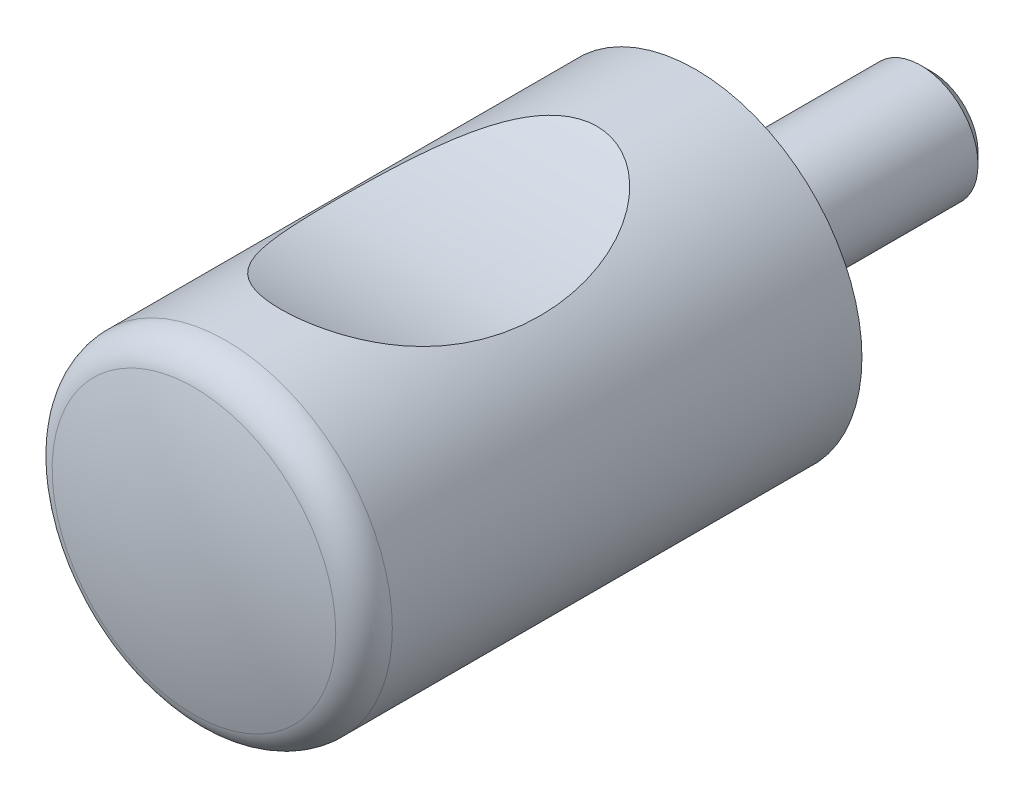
ISO-10303-21;
HEADER;
FILE_DESCRIPTION(('STEP AP214'),'2;1');
FILE_NAME('part.step','',(''),(''),'','','');
FILE_SCHEMA(('AUTOMOTIVE_DESIGN { 1 0 10303 214 1 1 1 1 }'));
ENDSEC;
DATA;
#1=APPLICATION_CONTEXT('core data for automotive mechanical design processes');
#2=APPLICATION_PROTOCOL_DEFINITION('international standard','automotive_design',2000,#1);
#3=PRODUCT_CONTEXT('',#1,'mechanical');
#4=PRODUCT('Part','Part','',(#3));
#5=PRODUCT_RELATED_PRODUCT_CATEGORY('part','',(#4));
#6=PRODUCT_DEFINITION_FORMATION('','',#4);
#7=PRODUCT_DEFINITION_CONTEXT('part definition',#1,'design');
#8=PRODUCT_DEFINITION('design','',#6,#7);
#9=PRODUCT_DEFINITION_SHAPE('','',#8);
#10=(LENGTH_UNIT() NAMED_UNIT(*) SI_UNIT(.MILLI.,.METRE.));
#11=(NAMED_UNIT(*) PLANE_ANGLE_UNIT() SI_UNIT($,.RADIAN.));
#12=(NAMED_UNIT(*) SI_UNIT($,.STERADIAN.) SOLID_ANGLE_UNIT());
#13=UNCERTAINTY_MEASURE_WITH_UNIT(LENGTH_MEASURE(1.E-05),#10,'distance_accuracy_value','');
#14=(GEOMETRIC_REPRESENTATION_CONTEXT(3) GLOBAL_UNCERTAINTY_ASSIGNED_CONTEXT((#13)) GLOBAL_UNIT_ASSIGNED_CONTEXT((#10,
#11,#12)) REPRESENTATION_CONTEXT('',''));
#15=CARTESIAN_POINT('',(0.,0.,0.));
#16=DIRECTION('',(0.,0.,1.));
#17=DIRECTION('',(1.,0.,0.));
#18=AXIS2_PLACEMENT_3D('',#15,#16,#17);
#19=CARTESIAN_POINT('',(0.,0.,23.));
#20=DIRECTION('',(0.,0.,1.));
#21=DIRECTION('',(1.,0.,0.));
#22=AXIS2_PLACEMENT_3D('',#19,#20,#21);
#23=CYLINDRICAL_SURFACE('',#22,7.25);
#24=CARTESIAN_POINT('',(0.,0.,20.770888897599));
#25=DIRECTION('',(0.,0.,1.));
#26=DIRECTION('',(1.,0.,0.));
#27=AXIS2_PLACEMENT_3D('',#24,#25,#26);
#28=CIRCLE('',#27,7.25);
#29=CARTESIAN_POINT('',(7.25,0.,20.770888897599));
#30=VERTEX_POINT('',#29);
#31=EDGE_CURVE('E188',#30,#30,#28,.T.);
#32=ORIENTED_EDGE('',*,*,#31,.F.);
#33=EDGE_LOOP('',(#32));
#34=FACE_BOUND('',#33,.T.);
#35=CARTESIAN_POINT('',(0.,-7.25,18.4));
#36=CARTESIAN_POINT('',(-0.175963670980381,-7.24999096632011,18.399986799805));
#37=CARTESIAN_POINT('',(-0.352150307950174,-7.24352339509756,18.3858618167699));
#38=CARTESIAN_POINT('',(-0.699380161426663,-7.2182982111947,18.3301694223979));
#39=CARTESIAN_POINT('',(-0.870412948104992,-7.19951722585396,18.2885498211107));
#40=CARTESIAN_POINT('',(-1.20184605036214,-7.15164102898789,18.1805220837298));
#41=CARTESIAN_POINT('',(-1.3622971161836,-7.12260006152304,18.1142442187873));
#42=CARTESIAN_POINT('',(-1.67057102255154,-7.056670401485,17.96013569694));
#43=CARTESIAN_POINT('',(-1.81839310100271,-7.01978123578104,17.8723037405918));
#44=CARTESIAN_POINT('',(-2.16043579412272,-6.92377876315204,17.6368450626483));
#45=CARTESIAN_POINT('',(-2.34735612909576,-6.86192041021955,17.4797310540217));
#46=CARTESIAN_POINT('',(-2.69195419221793,-6.73423170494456,17.1374260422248));
#47=CARTESIAN_POINT('',(-2.84956648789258,-6.66839288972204,16.95217385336));
#48=CARTESIAN_POINT('',(-3.0960845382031,-6.55663282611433,16.6169955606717));
#49=CARTESIAN_POINT('',(-3.19176954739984,-6.51038287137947,16.472048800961));
#50=CARTESIAN_POINT('',(-3.37006628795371,-6.4199036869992,16.1736616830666));
#51=CARTESIAN_POINT('',(-3.45267252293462,-6.37567531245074,16.0202177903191));
#52=CARTESIAN_POINT('',(-3.6058804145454,-6.29029604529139,15.706424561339));
#53=CARTESIAN_POINT('',(-3.67646704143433,-6.24914904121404,15.5460668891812));
#54=CARTESIAN_POINT('',(-3.80652493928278,-6.17078779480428,15.2199563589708));
#55=CARTESIAN_POINT('',(-3.86599309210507,-6.13357465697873,15.0542020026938));
#56=CARTESIAN_POINT('',(-3.9974687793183,-6.04906580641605,14.6481150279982));
#57=CARTESIAN_POINT('',(-4.06429981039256,-6.00407313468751,14.4056172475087));
#58=CARTESIAN_POINT('',(-4.17950632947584,-5.9244498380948,13.9145871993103));
#59=CARTESIAN_POINT('',(-4.22787433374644,-5.88982341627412,13.6660525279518));
#60=CARTESIAN_POINT('',(-4.30774552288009,-5.83166086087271,13.1647723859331));
#61=CARTESIAN_POINT('',(-4.33923191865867,-5.80813577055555,12.9120229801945));
#62=CARTESIAN_POINT('',(-4.38630405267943,-5.77266826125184,12.4042936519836));
#63=CARTESIAN_POINT('',(-4.40189183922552,-5.76072435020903,12.1493140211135));
#64=CARTESIAN_POINT('',(-4.41787237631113,-5.74847889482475,11.6328496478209));
#65=CARTESIAN_POINT('',(-4.41791504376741,-5.74844558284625,11.3713477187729));
#66=CARTESIAN_POINT('',(-4.40192810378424,-5.76069716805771,10.8490841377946));
#67=CARTESIAN_POINT('',(-4.38589635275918,-5.7729837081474,10.5883225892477));
#68=CARTESIAN_POINT('',(-4.33722045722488,-5.80964263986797,10.0694194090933));
#69=CARTESIAN_POINT('',(-4.30459016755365,-5.83400495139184,9.8112757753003));
#70=CARTESIAN_POINT('',(-4.22160591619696,-5.89433595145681,9.29925592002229));
#71=CARTESIAN_POINT('',(-4.17125768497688,-5.93030088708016,9.04537834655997));
#72=CARTESIAN_POINT('',(-4.06718842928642,-6.00194149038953,8.61110020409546));
#73=CARTESIAN_POINT('',(-4.01796762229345,-6.03512398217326,8.42920132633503));
#74=CARTESIAN_POINT('',(-3.90821191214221,-6.10677364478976,8.06992783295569));
#75=CARTESIAN_POINT('',(-3.84767956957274,-6.14523961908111,7.89255220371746));
#76=CARTESIAN_POINT('',(-3.71432776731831,-6.22674668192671,7.54376554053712));
#77=CARTESIAN_POINT('',(-3.64152239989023,-6.26978250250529,7.37234793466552));
#78=CARTESIAN_POINT('',(-3.48244279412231,-6.35951359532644,7.03694226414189));
#79=CARTESIAN_POINT('',(-3.39617338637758,-6.40620755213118,6.87295156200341));
#80=CARTESIAN_POINT('',(-3.17081522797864,-6.52153594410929,6.4894978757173));
#81=CARTESIAN_POINT('',(-3.02450122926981,-6.5913822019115,6.27454066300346));
#82=CARTESIAN_POINT('',(-2.69955137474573,-6.73097578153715,5.87053555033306));
#83=CARTESIAN_POINT('',(-2.52096662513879,-6.80072308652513,5.68144750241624));
#84=CARTESIAN_POINT('',(-2.17492151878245,-6.91790982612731,5.37811404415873));
#85=CARTESIAN_POINT('',(-2.01430694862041,-6.96679630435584,5.25665033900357));
#86=CARTESIAN_POINT('',(-1.67374081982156,-7.05633828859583,5.04013040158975));
#87=CARTESIAN_POINT('',(-1.49379770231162,-7.09699736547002,4.9450627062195));
#88=CARTESIAN_POINT('',(-1.21124219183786,-7.14875847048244,4.82616259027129));
#89=CARTESIAN_POINT('',(-1.11439692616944,-7.16453348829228,4.79035252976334));
#90=CARTESIAN_POINT('',(-0.917400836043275,-7.19240900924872,4.72753276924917));
#91=CARTESIAN_POINT('',(-0.817251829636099,-7.20451149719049,4.70051831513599));
#92=CARTESIAN_POINT('',(-0.614534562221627,-7.22462526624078,4.6558322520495));
#93=CARTESIAN_POINT('',(-0.511967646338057,-7.23263876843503,4.63815557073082));
#94=CARTESIAN_POINT('',(-0.305423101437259,-7.24430401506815,4.61248197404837));
#95=CARTESIAN_POINT('',(-0.201445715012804,-7.24795650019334,4.60448341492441));
#96=CARTESIAN_POINT('',(0.0798112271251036,-7.25171185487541,4.59623996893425));
#97=CARTESIAN_POINT('',(0.257528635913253,-7.2475493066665,4.60532219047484));
#98=CARTESIAN_POINT('',(0.608354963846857,-7.22657400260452,4.65152285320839));
#99=CARTESIAN_POINT('',(0.781464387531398,-7.20976263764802,4.68863821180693));
#100=CARTESIAN_POINT('',(1.11344433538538,-7.16588848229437,4.78716411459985));
#101=CARTESIAN_POINT('',(1.27258576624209,-7.13914702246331,4.84781556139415));
#102=CARTESIAN_POINT('',(1.57924219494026,-7.07764155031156,4.9904533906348));
#103=CARTESIAN_POINT('',(1.72675294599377,-7.04287462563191,5.07244751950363));
#104=CARTESIAN_POINT('',(2.06759703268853,-6.95200467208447,5.2928075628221));
#105=CARTESIAN_POINT('',(2.25421533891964,-6.89306729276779,5.44039549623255));
#106=CARTESIAN_POINT('',(2.59963913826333,-6.77039118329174,5.76358115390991));
#107=CARTESIAN_POINT('',(2.75838522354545,-6.70664260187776,5.93923721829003));
#108=CARTESIAN_POINT('',(3.00699334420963,-6.59796437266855,6.25720709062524));
#109=CARTESIAN_POINT('',(3.10348360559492,-6.55293661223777,6.39442456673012));
#110=CARTESIAN_POINT('',(3.28395601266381,-6.46438320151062,6.67737510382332));
#111=CARTESIAN_POINT('',(3.36793301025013,-6.42085817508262,6.82311163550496));
#112=CARTESIAN_POINT('',(3.52434555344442,-6.33635532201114,7.12156023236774));
#113=CARTESIAN_POINT('',(3.59676646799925,-6.29538076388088,7.27428083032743));
#114=CARTESIAN_POINT('',(3.73088098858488,-6.21683657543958,7.58522626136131));
#115=CARTESIAN_POINT('',(3.79257151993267,-6.17926792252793,7.74345265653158));
#116=CARTESIAN_POINT('',(3.93063496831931,-6.09277147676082,8.13375650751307));
#117=CARTESIAN_POINT('',(4.00180463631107,-6.04596583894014,8.36815485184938));
#118=CARTESIAN_POINT('',(4.12597503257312,-5.96191480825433,8.84341161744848));
#119=CARTESIAN_POINT('',(4.17896810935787,-5.92467344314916,9.08427271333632));
#120=CARTESIAN_POINT('',(4.26843451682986,-5.86054564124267,9.57061338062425));
#121=CARTESIAN_POINT('',(4.30489239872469,-5.83366889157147,9.81609704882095));
#122=CARTESIAN_POINT('',(4.36235554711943,-5.79082305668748,10.3097549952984));
#123=CARTESIAN_POINT('',(4.38336279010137,-5.77485257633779,10.5579289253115));
#124=CARTESIAN_POINT('',(4.41095280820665,-5.75380794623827,11.0620088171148));
#125=CARTESIAN_POINT('',(4.4171469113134,-5.74902747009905,11.3179482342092));
#126=CARTESIAN_POINT('',(4.41418686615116,-5.75130051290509,11.8297142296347));
#127=CARTESIAN_POINT('',(4.40503103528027,-5.75835532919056,12.0855407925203));
#128=CARTESIAN_POINT('',(4.37107091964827,-5.78417621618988,12.595437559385));
#129=CARTESIAN_POINT('',(4.34627446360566,-5.80293642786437,12.849508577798));
#130=CARTESIAN_POINT('',(4.28022168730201,-5.85182929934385,13.3543754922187));
#131=CARTESIAN_POINT('',(4.2389692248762,-5.88195929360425,13.6051721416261));
#132=CARTESIAN_POINT('',(4.14902583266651,-5.94562340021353,14.0502614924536));
#133=CARTESIAN_POINT('',(4.1036388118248,-5.97716407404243,14.2455108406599));
#134=CARTESIAN_POINT('',(4.00071892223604,-6.04653692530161,14.6316806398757));
#135=CARTESIAN_POINT('',(3.94318561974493,-6.08436932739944,14.8226009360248));
#136=CARTESIAN_POINT('',(3.81491681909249,-6.16560400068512,15.1984934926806));
#137=CARTESIAN_POINT('',(3.74419845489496,-6.20899902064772,15.3834731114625));
#138=CARTESIAN_POINT('',(3.58822336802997,-6.30042103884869,15.7459374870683));
#139=CARTESIAN_POINT('',(3.50297244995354,-6.34844618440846,15.9234252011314));
#140=CARTESIAN_POINT('',(3.28194320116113,-6.46625280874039,16.3327645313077));
#141=CARTESIAN_POINT('',(3.13913191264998,-6.53751902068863,16.5604860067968));
#142=CARTESIAN_POINT('',(2.81978178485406,-6.68145778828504,16.9904711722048));
#143=CARTESIAN_POINT('',(2.64329457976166,-6.75412803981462,17.1927730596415));
#144=CARTESIAN_POINT('',(2.29965407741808,-6.87743843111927,17.5189719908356));
#145=CARTESIAN_POINT('',(2.13988987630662,-6.92926921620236,17.6501583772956));
#146=CARTESIAN_POINT('',(1.7996125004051,-7.02531143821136,17.886011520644));
#147=CARTESIAN_POINT('',(1.61911604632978,-7.06952894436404,17.9906994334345));
#148=CARTESIAN_POINT('',(1.26996681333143,-7.13976730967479,18.1536504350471));
#149=CARTESIAN_POINT('',(1.10386557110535,-7.16755141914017,18.2166101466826));
#150=CARTESIAN_POINT('',(0.762629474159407,-7.21181564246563,18.3159272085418));
#151=CARTESIAN_POINT('',(0.587517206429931,-7.22832266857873,18.3523479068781));
#152=CARTESIAN_POINT('',(0.342463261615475,-7.24223069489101,18.3829538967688));
#153=CARTESIAN_POINT('',(0.274174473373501,-7.24513742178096,18.3893363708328));
#154=CARTESIAN_POINT('',(0.137268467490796,-7.24902397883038,18.3978623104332));
#155=CARTESIAN_POINT('',(0.0686512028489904,-7.25000352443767,18.4000051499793));
#156=CARTESIAN_POINT('',(0.,-7.25,18.4));
#157=B_SPLINE_CURVE_WITH_KNOTS('',3,(#35,#36,#37,#38,#39,#40,#41,#42,#43,#44,#45,#46,#47,#48,
#49,#50,#51,#52,#53,#54,#55,#56,#57,#58,#59,#60,#61,#62,#63,#64,#65,#66,#67,#68,#69,#70,#71,#72,
#73,#74,#75,#76,#77,#78,#79,#80,#81,#82,#83,#84,#85,#86,#87,#88,#89,#90,#91,#92,#93,#94,#95,#96,
#97,#98,#99,#100,#101,#102,#103,#104,#105,#106,#107,#108,#109,#110,#111,#112,#113,#114,#115,
#116,#117,#118,#119,#120,#121,#122,#123,#124,#125,#126,#127,#128,#129,#130,#131,#132,#133,#134,
#135,#136,#137,#138,#139,#140,#141,#142,#143,#144,#145,#146,#147,#148,#149,#150,#151,#152,#153,
#154,#155,#156),.UNSPECIFIED.,.T.,.F.,(4,2,2,2,2,2,2,2,2,2,2,2,2,2,2,2,2,2,2,2,2,2,2,2,2,2,2,2,
2,2,2,2,2,2,2,2,2,2,2,2,2,2,2,2,2,2,2,2,2,2,2,2,2,2,2,2,2,2,2,2,4),(0.,0.527617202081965,
1.05623880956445,1.58210644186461,2.10800578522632,2.85951548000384,3.61268334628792,
4.15119655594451,4.68993547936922,5.22934319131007,5.76890195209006,6.5343942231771,
7.30019644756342,8.06675887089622,8.83322252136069,9.61694623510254,10.400774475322,
11.1839495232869,11.9668715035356,12.5404842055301,13.1139672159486,13.6867961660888,
14.2594200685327,15.0644993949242,15.8683147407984,16.4877369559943,17.1068897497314,
17.4198368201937,17.7326144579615,18.0452220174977,18.3577764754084,18.8887930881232,
19.419751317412,19.9348441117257,20.4501241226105,21.181422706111,21.9142615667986,
22.4346529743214,22.9552578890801,23.4765167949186,23.9979248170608,24.7450274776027,
25.4924442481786,26.2405578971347,26.9885758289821,27.7560149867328,28.5235382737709,
29.2906776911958,30.0576373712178,30.6659453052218,31.2742749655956,31.8818195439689,
32.4891220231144,33.3207053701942,34.1510237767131,34.7880764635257,35.4246189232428,
35.9617665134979,36.4976277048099,36.703444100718,36.9092908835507),.UNSPECIFIED.);
#158=CARTESIAN_POINT('',(0.,-7.25,18.4));
#159=VERTEX_POINT('',#158);
#160=EDGE_CURVE('E9',#159,#159,#157,.T.);
#161=ORIENTED_EDGE('',*,*,#160,.F.);
#162=EDGE_LOOP('',(#161));
#163=FACE_BOUND('',#162,.T.);
#164=CARTESIAN_POINT('',(0.,7.25,4.6));
#165=CARTESIAN_POINT('',(-0.175963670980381,7.24999096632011,4.60001320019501));
#166=CARTESIAN_POINT('',(-0.352150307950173,7.24352339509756,4.61413818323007));
#167=CARTESIAN_POINT('',(-0.699380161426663,7.2182982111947,4.66983057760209));
#168=CARTESIAN_POINT('',(-0.870412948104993,7.19951722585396,4.71145017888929));
#169=CARTESIAN_POINT('',(-1.20184605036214,7.15164102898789,4.81947791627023));
#170=CARTESIAN_POINT('',(-1.3622971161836,7.12260006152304,4.88575578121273));
#171=CARTESIAN_POINT('',(-1.67057102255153,7.056670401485,5.03986430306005));
#172=CARTESIAN_POINT('',(-1.81839310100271,7.01978123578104,5.12769625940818));
#173=CARTESIAN_POINT('',(-2.16043579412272,6.92377876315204,5.36315493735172));
#174=CARTESIAN_POINT('',(-2.34735612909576,6.86192041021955,5.52026894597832));
#175=CARTESIAN_POINT('',(-2.69195419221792,6.73423170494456,5.8625739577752));
#176=CARTESIAN_POINT('',(-2.84956648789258,6.66839288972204,6.04782614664));
#177=CARTESIAN_POINT('',(-3.09608453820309,6.55663282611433,6.3830044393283));
#178=CARTESIAN_POINT('',(-3.19176954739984,6.51038287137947,6.52795119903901));
#179=CARTESIAN_POINT('',(-3.37006628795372,6.41990368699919,6.82633831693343));
#180=CARTESIAN_POINT('',(-3.45267252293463,6.37567531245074,6.97978220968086));
#181=CARTESIAN_POINT('',(-3.6058804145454,6.29029604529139,7.29357543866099));
#182=CARTESIAN_POINT('',(-3.67646704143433,6.24914904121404,7.45393311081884));
#183=CARTESIAN_POINT('',(-3.80652493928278,6.17078779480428,7.78004364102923));
#184=CARTESIAN_POINT('',(-3.86599309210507,6.13357465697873,7.94579799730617));
#185=CARTESIAN_POINT('',(-3.99746877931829,6.04906580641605,8.35188497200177));
#186=CARTESIAN_POINT('',(-4.06429981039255,6.00407313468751,8.5943827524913));
#187=CARTESIAN_POINT('',(-4.17950632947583,5.9244498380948,9.08541280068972));
#188=CARTESIAN_POINT('',(-4.22787433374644,5.88982341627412,9.33394747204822));
#189=CARTESIAN_POINT('',(-4.30774552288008,5.83166086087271,9.83522761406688));
#190=CARTESIAN_POINT('',(-4.33923191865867,5.80813577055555,10.0879770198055));
#191=CARTESIAN_POINT('',(-4.38630405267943,5.77266826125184,10.5957063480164));
#192=CARTESIAN_POINT('',(-4.40189183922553,5.76072435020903,10.8506859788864));
#193=CARTESIAN_POINT('',(-4.41787237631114,5.74847889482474,11.3671503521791));
#194=CARTESIAN_POINT('',(-4.41791504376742,5.74844558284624,11.628652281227));
#195=CARTESIAN_POINT('',(-4.40192810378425,5.7606971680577,12.1509158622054));
#196=CARTESIAN_POINT('',(-4.38589635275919,5.77298370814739,12.4116774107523));
#197=CARTESIAN_POINT('',(-4.33722045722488,5.80964263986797,12.9305805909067));
#198=CARTESIAN_POINT('',(-4.30459016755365,5.83400495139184,13.1887242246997));
#199=CARTESIAN_POINT('',(-4.22160591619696,5.89433595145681,13.7007440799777));
#200=CARTESIAN_POINT('',(-4.17125768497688,5.93030088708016,13.95462165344));
#201=CARTESIAN_POINT('',(-4.06718842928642,6.00194149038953,14.3888997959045));
#202=CARTESIAN_POINT('',(-4.01796762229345,6.03512398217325,14.570798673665));
#203=CARTESIAN_POINT('',(-3.90821191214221,6.10677364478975,14.9300721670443));
#204=CARTESIAN_POINT('',(-3.84767956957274,6.14523961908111,15.1074477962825));
#205=CARTESIAN_POINT('',(-3.71432776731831,6.22674668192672,15.4562344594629));
#206=CARTESIAN_POINT('',(-3.64152239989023,6.26978250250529,15.6276520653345));
#207=CARTESIAN_POINT('',(-3.48244279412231,6.35951359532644,15.9630577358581));
#208=CARTESIAN_POINT('',(-3.39617338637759,6.40620755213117,16.1270484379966));
#209=CARTESIAN_POINT('',(-3.17081522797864,6.52153594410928,16.5105021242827));
#210=CARTESIAN_POINT('',(-3.02450122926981,6.5913822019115,16.7254593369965));
#211=CARTESIAN_POINT('',(-2.69955137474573,6.73097578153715,17.1294644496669));
#212=CARTESIAN_POINT('',(-2.5209666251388,6.80072308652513,17.3185524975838));
#213=CARTESIAN_POINT('',(-2.17492151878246,6.91790982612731,17.6218859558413));
#214=CARTESIAN_POINT('',(-2.01430694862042,6.96679630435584,17.7433496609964));
#215=CARTESIAN_POINT('',(-1.67374081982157,7.05633828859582,17.9598695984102));
#216=CARTESIAN_POINT('',(-1.49379770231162,7.09699736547,18.0549372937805));
#217=CARTESIAN_POINT('',(-1.21124219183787,7.14875847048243,18.1738374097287));
#218=CARTESIAN_POINT('',(-1.11439692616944,7.16453348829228,18.2096474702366));
#219=CARTESIAN_POINT('',(-0.917400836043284,7.19240900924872,18.2724672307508));
#220=CARTESIAN_POINT('',(-0.817251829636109,7.20451149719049,18.299481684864));
#221=CARTESIAN_POINT('',(-0.614534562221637,7.22462526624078,18.3441677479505));
#222=CARTESIAN_POINT('',(-0.511967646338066,7.23263876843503,18.3618444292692));
#223=CARTESIAN_POINT('',(-0.305423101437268,7.24430401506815,18.3875180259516));
#224=CARTESIAN_POINT('',(-0.201445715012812,7.24795650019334,18.3955165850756));
#225=CARTESIAN_POINT('',(0.0798112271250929,7.25171185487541,18.4037600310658));
#226=CARTESIAN_POINT('',(0.257528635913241,7.2475493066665,18.3946778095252));
#227=CARTESIAN_POINT('',(0.608354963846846,7.22657400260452,18.3484771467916));
#228=CARTESIAN_POINT('',(0.781464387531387,7.20976263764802,18.3113617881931));
#229=CARTESIAN_POINT('',(1.11344433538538,7.16588848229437,18.2128358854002));
#230=CARTESIAN_POINT('',(1.27258576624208,7.13914702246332,18.1521844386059));
#231=CARTESIAN_POINT('',(1.57924219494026,7.07764155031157,18.0095466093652));
#232=CARTESIAN_POINT('',(1.72675294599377,7.04287462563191,17.9275524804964));
#233=CARTESIAN_POINT('',(2.06759703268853,6.95200467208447,17.7071924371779));
#234=CARTESIAN_POINT('',(2.25421533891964,6.89306729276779,17.5596045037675));
#235=CARTESIAN_POINT('',(2.59963913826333,6.77039118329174,17.2364188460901));
#236=CARTESIAN_POINT('',(2.75838522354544,6.70664260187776,17.06076278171));
#237=CARTESIAN_POINT('',(3.00699334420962,6.59796437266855,16.7427929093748));
#238=CARTESIAN_POINT('',(3.10348360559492,6.55293661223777,16.6055754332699));
#239=CARTESIAN_POINT('',(3.2839560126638,6.46438320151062,16.3226248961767));
#240=CARTESIAN_POINT('',(3.36793301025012,6.42085817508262,16.1768883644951));
#241=CARTESIAN_POINT('',(3.5243455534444,6.33635532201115,15.8784397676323));
#242=CARTESIAN_POINT('',(3.59676646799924,6.29538076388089,15.7257191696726));
#243=CARTESIAN_POINT('',(3.73088098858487,6.21683657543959,15.4147737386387));
#244=CARTESIAN_POINT('',(3.79257151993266,6.17926792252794,15.2565473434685));
#245=CARTESIAN_POINT('',(3.9306349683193,6.09277147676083,14.866243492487));
#246=CARTESIAN_POINT('',(4.00180463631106,6.04596583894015,14.6318451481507));
#247=CARTESIAN_POINT('',(4.1259750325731,5.96191480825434,14.1565883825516));
#248=CARTESIAN_POINT('',(4.17896810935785,5.92467344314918,13.9157272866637));
#249=CARTESIAN_POINT('',(4.26843451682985,5.86054564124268,13.4293866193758));
#250=CARTESIAN_POINT('',(4.30489239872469,5.83366889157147,13.1839029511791));
#251=CARTESIAN_POINT('',(4.36235554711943,5.79082305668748,12.6902450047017));
#252=CARTESIAN_POINT('',(4.38336279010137,5.77485257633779,12.4420710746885));
#253=CARTESIAN_POINT('',(4.41095280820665,5.75380794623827,11.9379911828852));
#254=CARTESIAN_POINT('',(4.4171469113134,5.74902747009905,11.6820517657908));
#255=CARTESIAN_POINT('',(4.41418686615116,5.75130051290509,11.1702857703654));
#256=CARTESIAN_POINT('',(4.40503103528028,5.75835532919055,10.9144592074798));
#257=CARTESIAN_POINT('',(4.37107091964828,5.78417621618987,10.4045624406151));
#258=CARTESIAN_POINT('',(4.34627446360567,5.80293642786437,10.150491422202));
#259=CARTESIAN_POINT('',(4.28022168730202,5.85182929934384,9.64562450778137));
#260=CARTESIAN_POINT('',(4.2389692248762,5.88195929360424,9.39482785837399));
#261=CARTESIAN_POINT('',(4.14902583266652,5.94562340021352,8.94973850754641));
#262=CARTESIAN_POINT('',(4.1036388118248,5.97716407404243,8.7544891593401));
#263=CARTESIAN_POINT('',(4.00071892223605,6.0465369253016,8.36831936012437));
#264=CARTESIAN_POINT('',(3.94318561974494,6.08436932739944,8.17739906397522));
#265=CARTESIAN_POINT('',(3.8149168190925,6.16560400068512,7.80150650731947));
#266=CARTESIAN_POINT('',(3.74419845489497,6.20899902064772,7.61652688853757));
#267=CARTESIAN_POINT('',(3.58822336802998,6.30042103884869,7.25406251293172));
#268=CARTESIAN_POINT('',(3.50297244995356,6.34844618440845,7.07657479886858));
#269=CARTESIAN_POINT('',(3.28194320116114,6.46625280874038,6.66723546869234));
#270=CARTESIAN_POINT('',(3.13913191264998,6.53751902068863,6.43951399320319));
#271=CARTESIAN_POINT('',(2.81978178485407,6.68145778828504,6.00952882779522));
#272=CARTESIAN_POINT('',(2.64329457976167,6.75412803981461,5.8072269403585));
#273=CARTESIAN_POINT('',(2.2996540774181,6.87743843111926,5.48102800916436));
#274=CARTESIAN_POINT('',(2.13988987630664,6.92926921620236,5.3498416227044));
#275=CARTESIAN_POINT('',(1.79961250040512,7.02531143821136,5.11398847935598));
#276=CARTESIAN_POINT('',(1.61911604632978,7.06952894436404,5.00930056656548));
#277=CARTESIAN_POINT('',(1.26996681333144,7.13976730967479,4.84634956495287));
#278=CARTESIAN_POINT('',(1.10386557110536,7.16755141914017,4.78338985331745));
#279=CARTESIAN_POINT('',(0.762629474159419,7.21181564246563,4.68407279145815));
#280=CARTESIAN_POINT('',(0.587517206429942,7.22832266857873,4.64765209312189));
#281=CARTESIAN_POINT('',(0.342463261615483,7.24223069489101,4.61704610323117));
#282=CARTESIAN_POINT('',(0.274174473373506,7.24513742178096,4.61066362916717));
#283=CARTESIAN_POINT('',(0.137268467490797,7.24902397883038,4.60213768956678));
#284=CARTESIAN_POINT('',(0.0686512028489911,7.25000352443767,4.59999485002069));
#285=CARTESIAN_POINT('',(0.,7.25,4.6));
#286=B_SPLINE_CURVE_WITH_KNOTS('',3,(#164,#165,#166,#167,#168,#169,#170,#171,#172,#173,#174,
#175,#176,#177,#178,#179,#180,#181,#182,#183,#184,#185,#186,#187,#188,#189,#190,#191,#192,#193,
#194,#195,#196,#197,#198,#199,#200,#201,#202,#203,#204,#205,#206,#207,#208,#209,#210,#211,#212,
#213,#214,#215,#216,#217,#218,#219,#220,#221,#222,#223,#224,#225,#226,#227,#228,#229,#230,#231,
#232,#233,#234,#235,#236,#237,#238,#239,#240,#241,#242,#243,#244,#245,#246,#247,#248,#249,#250,
#251,#252,#253,#254,#255,#256,#257,#258,#259,#260,#261,#262,#263,#264,#265,#266,#267,#268,#269,
#270,#271,#272,#273,#274,#275,#276,#277,#278,#279,#280,#281,#282,#283,#284,#285),.UNSPECIFIED.,
.T.,.F.,(4,2,2,2,2,2,2,2,2,2,2,2,2,2,2,2,2,2,2,2,2,2,2,2,2,2,2,2,2,2,2,2,2,2,2,2,2,2,2,2,2,2,2,
2,2,2,2,2,2,2,2,2,2,2,2,2,2,2,2,2,4),(0.,0.527617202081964,1.05623880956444,1.58210644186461,
2.10800578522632,2.85951548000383,3.61268334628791,4.1511965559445,4.68993547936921,
5.22934319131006,5.76890195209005,6.53439422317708,7.30019644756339,8.06675887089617,
8.83322252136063,9.61694623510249,10.400774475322,11.1839495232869,11.9668715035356,
12.5404842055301,13.1139672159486,13.6867961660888,14.2594200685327,15.0644993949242,
15.8683147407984,16.4877369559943,17.1068897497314,17.4198368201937,17.7326144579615,
18.0452220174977,18.3577764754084,18.8887930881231,19.419751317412,19.9348441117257,
20.4501241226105,21.181422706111,21.9142615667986,22.4346529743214,22.9552578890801,
23.4765167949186,23.9979248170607,24.7450274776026,25.4924442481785,26.2405578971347,
26.9885758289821,27.7560149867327,28.5235382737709,29.2906776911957,30.0576373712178,
30.6659453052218,31.2742749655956,31.8818195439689,32.4891220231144,33.3207053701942,
34.1510237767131,34.7880764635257,35.4246189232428,35.9617665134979,36.4976277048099,
36.703444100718,36.9092908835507),.UNSPECIFIED.);
#287=CARTESIAN_POINT('',(0.,7.25,4.6));
#288=VERTEX_POINT('',#287);
#289=EDGE_CURVE('E27',#288,#288,#286,.T.);
#290=ORIENTED_EDGE('',*,*,#289,.F.);
#291=EDGE_LOOP('',(#290));
#292=FACE_BOUND('',#291,.T.);
#293=CARTESIAN_POINT('',(0.,0.,0.3));
#294=DIRECTION('',(0.,0.,1.));
#295=DIRECTION('',(1.,0.,0.));
#296=AXIS2_PLACEMENT_3D('',#293,#294,#295);
#297=CIRCLE('',#296,7.25);
#298=CARTESIAN_POINT('',(7.25,0.,0.3));
#299=VERTEX_POINT('',#298);
#300=EDGE_CURVE('E191',#299,#299,#297,.T.);
#301=ORIENTED_EDGE('',*,*,#300,.T.);
#302=EDGE_LOOP('',(#301));
#303=FACE_BOUND('',#302,.T.);
#304=ADVANCED_FACE('F14',(#34,#163,#292,#303),#23,.T.);
#305=CARTESIAN_POINT('',(0.,0.,-7.5));
#306=DIRECTION('',(0.,0.,1.));
#307=DIRECTION('',(1.,0.,0.));
#308=AXIS2_PLACEMENT_3D('',#305,#306,#307);
#309=PLANE('',#308);
#310=CARTESIAN_POINT('',(0.,0.,-7.5));
#311=DIRECTION('',(0.,0.,1.));
#312=DIRECTION('',(1.,0.,0.));
#313=AXIS2_PLACEMENT_3D('',#310,#311,#312);
#314=CIRCLE('',#313,1.25);
#315=CARTESIAN_POINT('',(0.625,-1.08253175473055,-7.5));
#316=VERTEX_POINT('',#315);
#317=CARTESIAN_POINT('',(-0.625,-1.08253175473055,-7.5));
#318=VERTEX_POINT('',#317);
#319=EDGE_CURVE('E200',#316,#318,#314,.F.);
#320=ORIENTED_EDGE('',*,*,#319,.F.);
#321=DIRECTION('',(0.866025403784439,0.5,0.));
#322=VECTOR('',#321,1.);
#323=CARTESIAN_POINT('',(0.,-1.44337567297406,-7.5));
#324=LINE('',#323,#322);
#325=CARTESIAN_POINT('',(0.,-1.44337567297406,-7.5));
#326=VERTEX_POINT('',#325);
#327=EDGE_CURVE('E130',#326,#316,#324,.T.);
#328=ORIENTED_EDGE('',*,*,#327,.F.);
#329=DIRECTION('',(0.866025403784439,-0.5,0.));
#330=VECTOR('',#329,1.);
#331=CARTESIAN_POINT('',(-1.25,-0.721687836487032,-7.5));
#332=LINE('',#331,#330);
#333=EDGE_CURVE('E125',#318,#326,#332,.T.);
#334=ORIENTED_EDGE('',*,*,#333,.F.);
#335=EDGE_LOOP('',(#320,#328,#334));
#336=FACE_BOUND('',#335,.T.);
#337=ADVANCED_FACE('F215',(#336),#309,.F.);
#338=CARTESIAN_POINT('',(-1.25,0.,-7.5));
#339=VERTEX_POINT('',#338);
#340=EDGE_CURVE('E102',#318,#339,#314,.F.);
#341=ORIENTED_EDGE('',*,*,#340,.F.);
#342=CARTESIAN_POINT('',(-1.25,-0.721687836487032,-7.5));
#343=VERTEX_POINT('',#342);
#344=EDGE_CURVE('E126',#343,#318,#332,.T.);
#345=ORIENTED_EDGE('',*,*,#344,.F.);
#346=DIRECTION('',(0.,-1.,0.));
#347=VECTOR('',#346,1.);
#348=CARTESIAN_POINT('',(-1.25,0.721687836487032,-7.5));
#349=LINE('',#348,#347);
#350=EDGE_CURVE('E122',#339,#343,#349,.T.);
#351=ORIENTED_EDGE('',*,*,#350,.F.);
#352=EDGE_LOOP('',(#341,#345,#351));
#353=FACE_BOUND('',#352,.T.);
#354=ADVANCED_FACE('F218',(#353),#309,.F.);
#355=CARTESIAN_POINT('',(-0.625,1.08253175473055,-7.5));
#356=VERTEX_POINT('',#355);
#357=EDGE_CURVE('E99',#339,#356,#314,.F.);
#358=ORIENTED_EDGE('',*,*,#357,.F.);
#359=CARTESIAN_POINT('',(-1.25,0.721687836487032,-7.5));
#360=VERTEX_POINT('',#359);
#361=EDGE_CURVE('E112',#360,#339,#349,.T.);
#362=ORIENTED_EDGE('',*,*,#361,.F.);
#363=DIRECTION('',(-0.866025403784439,-0.5,0.));
#364=VECTOR('',#363,1.);
#365=CARTESIAN_POINT('',(0.,1.44337567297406,-7.5));
#366=LINE('',#365,#364);
#367=EDGE_CURVE('E108',#356,#360,#366,.T.);
#368=ORIENTED_EDGE('',*,*,#367,.F.);
#369=EDGE_LOOP('',(#358,#362,#368));
#370=FACE_BOUND('',#369,.T.);
#371=ADVANCED_FACE('F110',(#370),#309,.F.);
#372=CARTESIAN_POINT('',(0.625,1.08253175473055,-7.5));
#373=VERTEX_POINT('',#372);
#374=EDGE_CURVE('E34',#356,#373,#314,.F.);
#375=ORIENTED_EDGE('',*,*,#374,.F.);
#376=CARTESIAN_POINT('',(0.,1.44337567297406,-7.5));
#377=VERTEX_POINT('',#376);
#378=EDGE_CURVE('E114',#377,#356,#366,.T.);
#379=ORIENTED_EDGE('',*,*,#378,.F.);
#380=DIRECTION('',(-0.866025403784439,0.5,0.));
#381=VECTOR('',#380,1.);
#382=CARTESIAN_POINT('',(1.25,0.721687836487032,-7.5));
#383=LINE('',#382,#381);
#384=EDGE_CURVE('E137',#373,#377,#383,.T.);
#385=ORIENTED_EDGE('',*,*,#384,.F.);
#386=EDGE_LOOP('',(#375,#379,#385));
#387=FACE_BOUND('',#386,.T.);
#388=ADVANCED_FACE('F318',(#387),#309,.F.);
#389=CARTESIAN_POINT('',(1.25,0.,-7.5));
#390=VERTEX_POINT('',#389);
#391=EDGE_CURVE('E106',#390,#316,#314,.F.);
#392=ORIENTED_EDGE('',*,*,#391,.F.);
#393=DIRECTION('',(0.,1.,0.));
#394=VECTOR('',#393,1.);
#395=CARTESIAN_POINT('',(1.25,-0.721687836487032,-7.5));
#396=LINE('',#395,#394);
#397=CARTESIAN_POINT('',(1.25,-0.721687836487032,-7.5));
#398=VERTEX_POINT('',#397);
#399=EDGE_CURVE('E134',#398,#390,#396,.T.);
#400=ORIENTED_EDGE('',*,*,#399,.F.);
#401=EDGE_CURVE('E129',#316,#398,#324,.T.);
#402=ORIENTED_EDGE('',*,*,#401,.F.);
#403=EDGE_LOOP('',(#392,#400,#402));
#404=FACE_BOUND('',#403,.T.);
#405=ADVANCED_FACE('F327',(#404),#309,.F.);
#406=EDGE_CURVE('E199',#373,#390,#314,.F.);
#407=ORIENTED_EDGE('',*,*,#406,.F.);
#408=CARTESIAN_POINT('',(1.25,0.721687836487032,-7.5));
#409=VERTEX_POINT('',#408);
#410=EDGE_CURVE('E138',#409,#373,#383,.T.);
#411=ORIENTED_EDGE('',*,*,#410,.F.);
#412=EDGE_CURVE('E133',#390,#409,#396,.T.);
#413=ORIENTED_EDGE('',*,*,#412,.F.);
#414=EDGE_LOOP('',(#407,#411,#413));
#415=FACE_BOUND('',#414,.T.);
#416=ADVANCED_FACE('F220',(#415),#309,.F.);
#417=CARTESIAN_POINT('',(0.,0.,-10.));
#418=DIRECTION('',(0.,0.,1.));
#419=DIRECTION('',(1.,0.,0.));
#420=AXIS2_PLACEMENT_3D('',#417,#418,#419);
#421=PLANE('',#420);
#422=CARTESIAN_POINT('',(0.,0.,-10.));
#423=DIRECTION('',(0.,0.,1.));
#424=DIRECTION('',(1.,0.,0.));
#425=AXIS2_PLACEMENT_3D('',#422,#423,#424);
#426=CIRCLE('',#425,2.0095);
#427=CARTESIAN_POINT('',(2.0095,0.,-10.));
#428=VERTEX_POINT('',#427);
#429=EDGE_CURVE('E182',#428,#428,#426,.T.);
#430=ORIENTED_EDGE('',*,*,#429,.F.);
#431=EDGE_LOOP('',(#430));
#432=FACE_BOUND('',#431,.T.);
#433=DIRECTION('',(-0.866025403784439,-0.5,0.));
#434=VECTOR('',#433,1.);
#435=CARTESIAN_POINT('',(0.,1.44337567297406,-10.));
#436=LINE('',#435,#434);
#437=CARTESIAN_POINT('',(0.,1.44337567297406,-10.));
#438=VERTEX_POINT('',#437);
#439=CARTESIAN_POINT('',(-1.25,0.721687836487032,-10.));
#440=VERTEX_POINT('',#439);
#441=EDGE_CURVE('E42',#438,#440,#436,.T.);
#442=ORIENTED_EDGE('',*,*,#441,.T.);
#443=DIRECTION('',(0.,-1.,0.));
#444=VECTOR('',#443,1.);
#445=CARTESIAN_POINT('',(-1.25,0.721687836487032,-10.));
#446=LINE('',#445,#444);
#447=CARTESIAN_POINT('',(-1.25,-0.721687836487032,-10.));
#448=VERTEX_POINT('',#447);
#449=EDGE_CURVE('E142',#440,#448,#446,.T.);
#450=ORIENTED_EDGE('',*,*,#449,.T.);
#451=DIRECTION('',(0.866025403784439,-0.5,0.));
#452=VECTOR('',#451,1.);
#453=CARTESIAN_POINT('',(-1.25,-0.721687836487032,-10.));
#454=LINE('',#453,#452);
#455=CARTESIAN_POINT('',(0.,-1.44337567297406,-10.));
#456=VERTEX_POINT('',#455);
#457=EDGE_CURVE('E145',#448,#456,#454,.T.);
#458=ORIENTED_EDGE('',*,*,#457,.T.);
#459=DIRECTION('',(0.866025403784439,0.5,0.));
#460=VECTOR('',#459,1.);
#461=CARTESIAN_POINT('',(0.,-1.44337567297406,-10.));
#462=LINE('',#461,#460);
#463=CARTESIAN_POINT('',(1.25,-0.721687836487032,-10.));
#464=VERTEX_POINT('',#463);
#465=EDGE_CURVE('E148',#456,#464,#462,.T.);
#466=ORIENTED_EDGE('',*,*,#465,.T.);
#467=DIRECTION('',(0.,1.,0.));
#468=VECTOR('',#467,1.);
#469=CARTESIAN_POINT('',(1.25,-0.721687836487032,-10.));
#470=LINE('',#469,#468);
#471=CARTESIAN_POINT('',(1.25,0.721687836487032,-10.));
#472=VERTEX_POINT('',#471);
#473=EDGE_CURVE('E151',#464,#472,#470,.T.);
#474=ORIENTED_EDGE('',*,*,#473,.T.);
#475=DIRECTION('',(-0.866025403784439,0.5,0.));
#476=VECTOR('',#475,1.);
#477=CARTESIAN_POINT('',(1.25,0.721687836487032,-10.));
#478=LINE('',#477,#476);
#479=EDGE_CURVE('E115',#472,#438,#478,.T.);
#480=ORIENTED_EDGE('',*,*,#479,.T.);
#481=EDGE_LOOP('',(#442,#450,#458,#466,#474,#480));
#482=FACE_BOUND('',#481,.T.);
#483=ADVANCED_FACE('F263',(#432,#482),#421,.F.);
#484=CARTESIAN_POINT('',(0.,0.,0.));
#485=DIRECTION('',(0.,0.,1.));
#486=DIRECTION('',(1.,0.,0.));
#487=AXIS2_PLACEMENT_3D('',#484,#485,#486);
#488=PLANE('',#487);
#489=CARTESIAN_POINT('',(0.,0.,0.));
#490=DIRECTION('',(0.,0.,1.));
#491=DIRECTION('',(1.,0.,0.));
#492=AXIS2_PLACEMENT_3D('',#489,#490,#491);
#493=CIRCLE('',#492,3.25);
#494=CARTESIAN_POINT('',(3.25,0.,0.));
#495=VERTEX_POINT('',#494);
#496=EDGE_CURVE('E197',#495,#495,#493,.T.);
#497=ORIENTED_EDGE('',*,*,#496,.F.);
#498=EDGE_LOOP('',(#497));
#499=FACE_BOUND('',#498,.T.);
#500=CARTESIAN_POINT('',(0.,0.,0.));
#501=DIRECTION('',(0.,0.,1.));
#502=DIRECTION('',(1.,0.,0.));
#503=AXIS2_PLACEMENT_3D('',#500,#501,#502);
#504=CIRCLE('',#503,1.9);
#505=CARTESIAN_POINT('',(1.9,0.,0.));
#506=VERTEX_POINT('',#505);
#507=EDGE_CURVE('E167',#506,#506,#504,.T.);
#508=ORIENTED_EDGE('',*,*,#507,.T.);
#509=EDGE_LOOP('',(#508));
#510=FACE_BOUND('',#509,.T.);
#511=ADVANCED_FACE('F16',(#499,#510),#488,.F.);
#512=CARTESIAN_POINT('',(0.,0.,23.));
#513=DIRECTION('',(0.,0.,1.));
#514=DIRECTION('',(1.,0.,0.));
#515=AXIS2_PLACEMENT_3D('',#512,#513,#514);
#516=CYLINDRICAL_SURFACE('',#515,3.25);
#517=CARTESIAN_POINT('',(0.,0.,0.3));
#518=DIRECTION('',(0.,0.,1.));
#519=DIRECTION('',(1.,0.,0.));
#520=AXIS2_PLACEMENT_3D('',#517,#518,#519);
#521=CIRCLE('',#520,3.25);
#522=CARTESIAN_POINT('',(3.25,0.,0.3));
#523=VERTEX_POINT('',#522);
#524=EDGE_CURVE('E194',#523,#523,#521,.T.);
#525=ORIENTED_EDGE('',*,*,#524,.F.);
#526=EDGE_LOOP('',(#525));
#527=FACE_BOUND('',#526,.T.);
#528=ORIENTED_EDGE('',*,*,#496,.T.);
#529=EDGE_LOOP('',(#528));
#530=FACE_BOUND('',#529,.T.);
#531=ADVANCED_FACE('F278',(#527,#530),#516,.T.);
#532=CARTESIAN_POINT('',(0.,3.25,0.3));
#533=DIRECTION('',(0.,0.,1.));
#534=DIRECTION('',(1.,0.,0.));
#535=AXIS2_PLACEMENT_3D('',#532,#533,#534);
#536=PLANE('',#535);
#537=ORIENTED_EDGE('',*,*,#300,.F.);
#538=EDGE_LOOP('',(#537));
#539=FACE_BOUND('',#538,.T.);
#540=ORIENTED_EDGE('',*,*,#524,.T.);
#541=EDGE_LOOP('',(#540));
#542=FACE_BOUND('',#541,.T.);
#543=ADVANCED_FACE('F271',(#539,#542),#536,.F.);
#544=CARTESIAN_POINT('',(0.,0.,20.770888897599));
#545=DIRECTION('',(0.,0.,1.));
#546=DIRECTION('',(1.,0.,0.));
#547=AXIS2_PLACEMENT_3D('',#544,#545,#546);
#548=TOROIDAL_SURFACE('',#547,5.8,1.45);
#549=ORIENTED_EDGE('',*,*,#31,.T.);
#550=EDGE_LOOP('',(#549));
#551=FACE_BOUND('',#550,.T.);
#552=CARTESIAN_POINT('',(0.,0.,22.1694876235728));
#553=DIRECTION('',(0.,0.,1.));
#554=DIRECTION('',(1.,0.,0.));
#555=AXIS2_PLACEMENT_3D('',#552,#553,#554);
#556=CIRCLE('',#555,6.18265075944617);
#557=CARTESIAN_POINT('',(6.18265075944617,0.,22.1694876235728));
#558=VERTEX_POINT('',#557);
#559=EDGE_CURVE('E185',#558,#558,#556,.T.);
#560=ORIENTED_EDGE('',*,*,#559,.F.);
#561=EDGE_LOOP('',(#560));
#562=FACE_BOUND('',#561,.T.);
#563=ADVANCED_FACE('F268',(#551,#562),#548,.T.);
#564=CARTESIAN_POINT('',(0.,0.,-0.42826086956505));
#565=DIRECTION('',(0.,0.,1.));
#566=DIRECTION('',(0.,-1.,0.));
#567=AXIS2_PLACEMENT_3D('',#564,#565,#566);
#568=SPHERICAL_SURFACE('',#567,23.4282608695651);
#569=ORIENTED_EDGE('',*,*,#559,.T.);
#570=EDGE_LOOP('',(#569));
#571=FACE_BOUND('',#570,.T.);
#572=ADVANCED_FACE('F261',(#571),#568,.T.);
#573=CARTESIAN_POINT('',(0.,0.,-10.));
#574=DIRECTION('',(0.,0.,1.));
#575=DIRECTION('',(1.,0.,0.));
#576=AXIS2_PLACEMENT_3D('',#573,#574,#575);
#577=CONICAL_SURFACE('',#576,2.0095,0.785398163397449);
#578=CARTESIAN_POINT('',(0.,0.,-9.5095));
#579=DIRECTION('',(0.,0.,1.));
#580=DIRECTION('',(1.,0.,0.));
#581=AXIS2_PLACEMENT_3D('',#578,#579,#580);
#582=CIRCLE('',#581,2.5);
#583=CARTESIAN_POINT('',(2.5,0.,-9.5095));
#584=VERTEX_POINT('',#583);
#585=EDGE_CURVE('E179',#584,#584,#582,.T.);
#586=ORIENTED_EDGE('',*,*,#585,.F.);
#587=EDGE_LOOP('',(#586));
#588=FACE_BOUND('',#587,.T.);
#589=ORIENTED_EDGE('',*,*,#429,.T.);
#590=EDGE_LOOP('',(#589));
#591=FACE_BOUND('',#590,.T.);
#592=ADVANCED_FACE('F257',(#588,#591),#577,.T.);
#593=CARTESIAN_POINT('',(0.,0.,0.));
#594=DIRECTION('',(0.,0.,1.));
#595=DIRECTION('',(1.,0.,0.));
#596=AXIS2_PLACEMENT_3D('',#593,#594,#595);
#597=CYLINDRICAL_SURFACE('',#596,2.5);
#598=CARTESIAN_POINT('',(0.,0.,-1.4905));
#599=DIRECTION('',(0.,0.,1.));
#600=DIRECTION('',(1.,0.,0.));
#601=AXIS2_PLACEMENT_3D('',#598,#599,#600);
#602=CIRCLE('',#601,2.5);
#603=CARTESIAN_POINT('',(2.5,0.,-1.4905));
#604=VERTEX_POINT('',#603);
#605=EDGE_CURVE('E176',#604,#604,#602,.T.);
#606=ORIENTED_EDGE('',*,*,#605,.F.);
#607=EDGE_LOOP('',(#606));
#608=FACE_BOUND('',#607,.T.);
#609=ORIENTED_EDGE('',*,*,#585,.T.);
#610=EDGE_LOOP('',(#609));
#611=FACE_BOUND('',#610,.T.);
#612=ADVANCED_FACE('F253',(#608,#611),#597,.T.);
#613=CARTESIAN_POINT('',(0.,0.,-1.4905));
#614=DIRECTION('',(0.,0.,-1.));
#615=DIRECTION('',(-1.,0.,0.));
#616=AXIS2_PLACEMENT_3D('',#613,#614,#615);
#617=CONICAL_SURFACE('',#616,2.5,0.785398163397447);
#618=CARTESIAN_POINT('',(0.,0.,-1.));
#619=DIRECTION('',(0.,0.,1.));
#620=DIRECTION('',(1.,0.,0.));
#621=AXIS2_PLACEMENT_3D('',#618,#619,#620);
#622=CIRCLE('',#621,2.0095);
#623=CARTESIAN_POINT('',(2.0095,0.,-1.));
#624=VERTEX_POINT('',#623);
#625=EDGE_CURVE('E173',#624,#624,#622,.T.);
#626=ORIENTED_EDGE('',*,*,#625,.F.);
#627=EDGE_LOOP('',(#626));
#628=FACE_BOUND('',#627,.T.);
#629=ORIENTED_EDGE('',*,*,#605,.T.);
#630=EDGE_LOOP('',(#629));
#631=FACE_BOUND('',#630,.T.);
#632=ADVANCED_FACE('F249',(#628,#631),#617,.T.);
#633=CARTESIAN_POINT('',(0.,2.0095,-1.));
#634=DIRECTION('',(0.,0.,-1.));
#635=DIRECTION('',(-1.,0.,0.));
#636=AXIS2_PLACEMENT_3D('',#633,#634,#635);
#637=PLANE('',#636);
#638=CARTESIAN_POINT('',(0.,0.,-1.));
#639=DIRECTION('',(0.,0.,1.));
#640=DIRECTION('',(1.,0.,0.));
#641=AXIS2_PLACEMENT_3D('',#638,#639,#640);
#642=CIRCLE('',#641,1.9);
#643=CARTESIAN_POINT('',(1.9,0.,-1.));
#644=VERTEX_POINT('',#643);
#645=EDGE_CURVE('E170',#644,#644,#642,.T.);
#646=ORIENTED_EDGE('',*,*,#645,.F.);
#647=EDGE_LOOP('',(#646));
#648=FACE_BOUND('',#647,.T.);
#649=ORIENTED_EDGE('',*,*,#625,.T.);
#650=EDGE_LOOP('',(#649));
#651=FACE_BOUND('',#650,.T.);
#652=ADVANCED_FACE('F245',(#648,#651),#637,.F.);
#653=CARTESIAN_POINT('',(0.,0.,0.));
#654=DIRECTION('',(0.,0.,1.));
#655=DIRECTION('',(1.,0.,0.));
#656=AXIS2_PLACEMENT_3D('',#653,#654,#655);
#657=CYLINDRICAL_SURFACE('',#656,1.9);
#658=ORIENTED_EDGE('',*,*,#507,.F.);
#659=EDGE_LOOP('',(#658));
#660=FACE_BOUND('',#659,.T.);
#661=ORIENTED_EDGE('',*,*,#645,.T.);
#662=EDGE_LOOP('',(#661));
#663=FACE_BOUND('',#662,.T.);
#664=ADVANCED_FACE('F242',(#660,#663),#657,.T.);
#665=CARTESIAN_POINT('',(0.,1.44337567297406,-7.5));
#666=DIRECTION('',(0.5,-0.866025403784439,0.));
#667=DIRECTION('',(0.866025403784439,0.5,0.));
#668=AXIS2_PLACEMENT_3D('',#665,#666,#667);
#669=PLANE('',#668);
#670=ORIENTED_EDGE('',*,*,#441,.F.);
#671=DIRECTION('',(0.,0.,-1.));
#672=VECTOR('',#671,1.);
#673=CARTESIAN_POINT('',(0.,1.44337567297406,-7.5));
#674=LINE('',#673,#672);
#675=EDGE_CURVE('E119',#377,#438,#674,.T.);
#676=ORIENTED_EDGE('',*,*,#675,.F.);
#677=ORIENTED_EDGE('',*,*,#378,.T.);
#678=ORIENTED_EDGE('',*,*,#367,.T.);
#679=DIRECTION('',(0.,0.,-1.));
#680=VECTOR('',#679,1.);
#681=CARTESIAN_POINT('',(-1.25,0.721687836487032,-7.5));
#682=LINE('',#681,#680);
#683=EDGE_CURVE('E165',#360,#440,#682,.T.);
#684=ORIENTED_EDGE('',*,*,#683,.T.);
#685=EDGE_LOOP('',(#670,#676,#677,#678,#684));
#686=FACE_BOUND('',#685,.T.);
#687=ADVANCED_FACE('F118',(#686),#669,.T.);
#688=CARTESIAN_POINT('',(-1.25,0.721687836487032,-7.5));
#689=DIRECTION('',(1.,0.,0.));
#690=DIRECTION('',(0.,0.,-1.));
#691=AXIS2_PLACEMENT_3D('',#688,#689,#690);
#692=PLANE('',#691);
#693=ORIENTED_EDGE('',*,*,#449,.F.);
#694=ORIENTED_EDGE('',*,*,#683,.F.);
#695=ORIENTED_EDGE('',*,*,#361,.T.);
#696=ORIENTED_EDGE('',*,*,#350,.T.);
#697=DIRECTION('',(0.,0.,-1.));
#698=VECTOR('',#697,1.);
#699=CARTESIAN_POINT('',(-1.25,-0.721687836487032,-7.5));
#700=LINE('',#699,#698);
#701=EDGE_CURVE('E163',#343,#448,#700,.T.);
#702=ORIENTED_EDGE('',*,*,#701,.T.);
#703=EDGE_LOOP('',(#693,#694,#695,#696,#702));
#704=FACE_BOUND('',#703,.T.);
#705=ADVANCED_FACE('F235',(#704),#692,.T.);
#706=CARTESIAN_POINT('',(-1.25,-0.721687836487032,-7.5));
#707=DIRECTION('',(0.5,0.866025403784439,0.));
#708=DIRECTION('',(-0.866025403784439,0.5,0.));
#709=AXIS2_PLACEMENT_3D('',#706,#707,#708);
#710=PLANE('',#709);
#711=ORIENTED_EDGE('',*,*,#457,.F.);
#712=ORIENTED_EDGE('',*,*,#701,.F.);
#713=ORIENTED_EDGE('',*,*,#344,.T.);
#714=ORIENTED_EDGE('',*,*,#333,.T.);
#715=DIRECTION('',(0.,0.,-1.));
#716=VECTOR('',#715,1.);
#717=CARTESIAN_POINT('',(0.,-1.44337567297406,-7.5));
#718=LINE('',#717,#716);
#719=EDGE_CURVE('E161',#326,#456,#718,.T.);
#720=ORIENTED_EDGE('',*,*,#719,.T.);
#721=EDGE_LOOP('',(#711,#712,#713,#714,#720));
#722=FACE_BOUND('',#721,.T.);
#723=ADVANCED_FACE('F231',(#722),#710,.T.);
#724=CARTESIAN_POINT('',(0.,-1.44337567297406,-7.5));
#725=DIRECTION('',(-0.5,0.866025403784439,0.));
#726=DIRECTION('',(-0.866025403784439,-0.5,0.));
#727=AXIS2_PLACEMENT_3D('',#724,#725,#726);
#728=PLANE('',#727);
#729=ORIENTED_EDGE('',*,*,#465,.F.);
#730=ORIENTED_EDGE('',*,*,#719,.F.);
#731=ORIENTED_EDGE('',*,*,#327,.T.);
#732=ORIENTED_EDGE('',*,*,#401,.T.);
#733=DIRECTION('',(0.,0.,-1.));
#734=VECTOR('',#733,1.);
#735=CARTESIAN_POINT('',(1.25,-0.721687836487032,-7.5));
#736=LINE('',#735,#734);
#737=EDGE_CURVE('E159',#398,#464,#736,.T.);
#738=ORIENTED_EDGE('',*,*,#737,.T.);
#739=EDGE_LOOP('',(#729,#730,#731,#732,#738));
#740=FACE_BOUND('',#739,.T.);
#741=ADVANCED_FACE('F227',(#740),#728,.T.);
#742=CARTESIAN_POINT('',(1.25,-0.721687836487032,-7.5));
#743=DIRECTION('',(-1.,0.,0.));
#744=DIRECTION('',(0.,0.,1.));
#745=AXIS2_PLACEMENT_3D('',#742,#743,#744);
#746=PLANE('',#745);
#747=ORIENTED_EDGE('',*,*,#473,.F.);
#748=ORIENTED_EDGE('',*,*,#737,.F.);
#749=ORIENTED_EDGE('',*,*,#399,.T.);
#750=ORIENTED_EDGE('',*,*,#412,.T.);
#751=DIRECTION('',(0.,0.,-1.));
#752=VECTOR('',#751,1.);
#753=CARTESIAN_POINT('',(1.25,0.721687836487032,-7.5));
#754=LINE('',#753,#752);
#755=EDGE_CURVE('E157',#409,#472,#754,.T.);
#756=ORIENTED_EDGE('',*,*,#755,.T.);
#757=EDGE_LOOP('',(#747,#748,#749,#750,#756));
#758=FACE_BOUND('',#757,.T.);
#759=ADVANCED_FACE('F223',(#758),#746,.T.);
#760=CARTESIAN_POINT('',(1.25,0.721687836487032,-7.5));
#761=DIRECTION('',(-0.5,-0.866025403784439,0.));
#762=DIRECTION('',(0.866025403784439,-0.5,0.));
#763=AXIS2_PLACEMENT_3D('',#760,#761,#762);
#764=PLANE('',#763);
#765=ORIENTED_EDGE('',*,*,#479,.F.);
#766=ORIENTED_EDGE('',*,*,#755,.F.);
#767=ORIENTED_EDGE('',*,*,#410,.T.);
#768=ORIENTED_EDGE('',*,*,#384,.T.);
#769=ORIENTED_EDGE('',*,*,#675,.T.);
#770=EDGE_LOOP('',(#765,#766,#767,#768,#769));
#771=FACE_BOUND('',#770,.T.);
#772=ADVANCED_FACE('F96',(#771),#764,.T.);
#773=CARTESIAN_POINT('',(0.,0.,-7.5));
#774=DIRECTION('',(0.,0.,-1.));
#775=DIRECTION('',(-1.,0.,0.));
#776=AXIS2_PLACEMENT_3D('',#773,#774,#775);
#777=CONICAL_SURFACE('',#776,1.25,1.0471975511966);
#778=CARTESIAN_POINT('',(0.,0.,-6.77831216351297));
#779=VERTEX_POINT('',#778);
#780=VERTEX_LOOP('',#779);
#781=FACE_BOUND('',#780,.T.);
#782=ORIENTED_EDGE('',*,*,#357,.T.);
#783=ORIENTED_EDGE('',*,*,#374,.T.);
#784=ORIENTED_EDGE('',*,*,#406,.T.);
#785=ORIENTED_EDGE('',*,*,#391,.T.);
#786=ORIENTED_EDGE('',*,*,#319,.T.);
#787=ORIENTED_EDGE('',*,*,#340,.T.);
#788=EDGE_LOOP('',(#782,#783,#784,#785,#786,#787));
#789=FACE_BOUND('',#788,.T.);
#790=ADVANCED_FACE('F93',(#781,#789),#777,.F.);
#791=CARTESIAN_POINT('',(-7.25,22.37,11.5));
#792=DIRECTION('',(1.,0.,0.));
#793=DIRECTION('',(0.,0.,-1.));
#794=AXIS2_PLACEMENT_3D('',#791,#792,#793);
#795=CYLINDRICAL_SURFACE('',#794,16.62);
#796=ORIENTED_EDGE('',*,*,#289,.T.);
#797=EDGE_LOOP('',(#796));
#798=FACE_BOUND('',#797,.T.);
#799=ADVANCED_FACE('F95',(#798),#795,.F.);
#800=CARTESIAN_POINT('',(-7.25,-22.37,11.5));
#801=DIRECTION('',(1.,0.,0.));
#802=DIRECTION('',(0.,0.,-1.));
#803=AXIS2_PLACEMENT_3D('',#800,#801,#802);
#804=CYLINDRICAL_SURFACE('',#803,16.62);
#805=ORIENTED_EDGE('',*,*,#160,.T.);
#806=EDGE_LOOP('',(#805));
#807=FACE_BOUND('',#806,.T.);
#808=ADVANCED_FACE('F211',(#807),#804,.F.);
#809=CLOSED_SHELL('',(#304,#337,#354,#371,#388,#405,#416,#483,#511,#531,#543,#563,#572,#592,
#612,#632,#652,#664,#687,#705,#723,#741,#759,#772,#790,#799,#808));
#810=MANIFOLD_SOLID_BREP('B1',#809);
#811=ADVANCED_BREP_SHAPE_REPRESENTATION('',(#18,#810),#14);
#812=SHAPE_DEFINITION_REPRESENTATION(#9,#811);
ENDSEC;
END-ISO-10303-21;
